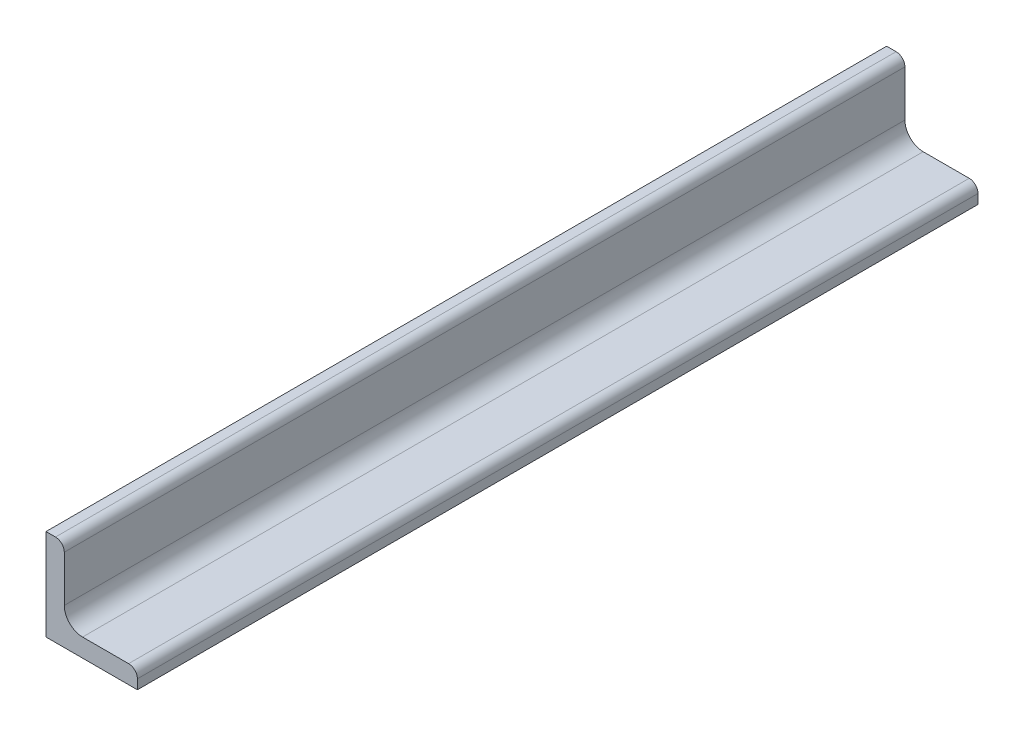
ISO-10303-21;
HEADER;
FILE_DESCRIPTION(('STEP AP214'),'2;1');
FILE_NAME('part.step','',(''),(''),'','','');
FILE_SCHEMA(('AUTOMOTIVE_DESIGN { 1 0 10303 214 1 1 1 1 }'));
ENDSEC;
DATA;
#1=APPLICATION_CONTEXT('core data for automotive mechanical design processes');
#2=APPLICATION_PROTOCOL_DEFINITION('international standard','automotive_design',2000,#1);
#3=PRODUCT_CONTEXT('',#1,'mechanical');
#4=PRODUCT('Part','Part','',(#3));
#5=PRODUCT_RELATED_PRODUCT_CATEGORY('part','',(#4));
#6=PRODUCT_DEFINITION_FORMATION('','',#4);
#7=PRODUCT_DEFINITION_CONTEXT('part definition',#1,'design');
#8=PRODUCT_DEFINITION('design','',#6,#7);
#9=PRODUCT_DEFINITION_SHAPE('','',#8);
#10=(LENGTH_UNIT() NAMED_UNIT(*) SI_UNIT(.MILLI.,.METRE.));
#11=(NAMED_UNIT(*) PLANE_ANGLE_UNIT() SI_UNIT($,.RADIAN.));
#12=(NAMED_UNIT(*) SI_UNIT($,.STERADIAN.) SOLID_ANGLE_UNIT());
#13=UNCERTAINTY_MEASURE_WITH_UNIT(LENGTH_MEASURE(1.E-05),#10,'distance_accuracy_value','');
#14=(GEOMETRIC_REPRESENTATION_CONTEXT(3) GLOBAL_UNCERTAINTY_ASSIGNED_CONTEXT((#13)) GLOBAL_UNIT_ASSIGNED_CONTEXT((#10,
#11,#12)) REPRESENTATION_CONTEXT('',''));
#15=CARTESIAN_POINT('',(0.,0.,0.));
#16=DIRECTION('',(0.,0.,1.));
#17=DIRECTION('',(1.,0.,0.));
#18=AXIS2_PLACEMENT_3D('',#15,#16,#17);
#19=CARTESIAN_POINT('',(25.,0.,115.));
#20=DIRECTION('',(0.,1.,0.));
#21=DIRECTION('',(-1.,0.,0.));
#22=AXIS2_PLACEMENT_3D('',#19,#20,#21);
#23=PLANE('',#22);
#24=DIRECTION('',(1.,0.,0.));
#25=VECTOR('',#24,1.);
#26=CARTESIAN_POINT('',(25.,0.,-115.));
#27=LINE('',#26,#25);
#28=CARTESIAN_POINT('',(0.,0.,-115.));
#29=VERTEX_POINT('',#28);
#30=CARTESIAN_POINT('',(25.,0.,-115.));
#31=VERTEX_POINT('',#30);
#32=EDGE_CURVE('E107',#29,#31,#27,.T.);
#33=ORIENTED_EDGE('',*,*,#32,.T.);
#34=DIRECTION('',(0.,0.,-1.));
#35=VECTOR('',#34,1.);
#36=CARTESIAN_POINT('',(25.,0.,115.));
#37=LINE('',#36,#35);
#38=CARTESIAN_POINT('',(25.,0.,115.));
#39=VERTEX_POINT('',#38);
#40=EDGE_CURVE('E113',#39,#31,#37,.T.);
#41=ORIENTED_EDGE('',*,*,#40,.F.);
#42=DIRECTION('',(1.,0.,0.));
#43=VECTOR('',#42,1.);
#44=CARTESIAN_POINT('',(25.,0.,115.));
#45=LINE('',#44,#43);
#46=CARTESIAN_POINT('',(0.,0.,115.));
#47=VERTEX_POINT('',#46);
#48=EDGE_CURVE('E138',#47,#39,#45,.T.);
#49=ORIENTED_EDGE('',*,*,#48,.F.);
#50=DIRECTION('',(0.,0.,-1.));
#51=VECTOR('',#50,1.);
#52=CARTESIAN_POINT('',(0.,0.,115.));
#53=LINE('',#52,#51);
#54=EDGE_CURVE('E125',#47,#29,#53,.T.);
#55=ORIENTED_EDGE('',*,*,#54,.T.);
#56=EDGE_LOOP('',(#33,#41,#49,#55));
#57=FACE_BOUND('',#56,.T.);
#58=ADVANCED_FACE('F33',(#57),#23,.F.);
#59=CARTESIAN_POINT('',(25.,5.,115.));
#60=DIRECTION('',(-1.,0.,0.));
#61=DIRECTION('',(0.,-1.,0.));
#62=AXIS2_PLACEMENT_3D('',#59,#60,#61);
#63=PLANE('',#62);
#64=DIRECTION('',(0.,1.,0.));
#65=VECTOR('',#64,1.);
#66=CARTESIAN_POINT('',(25.,5.,-115.));
#67=LINE('',#66,#65);
#68=CARTESIAN_POINT('',(25.,2.59999999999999,-115.));
#69=VERTEX_POINT('',#68);
#70=EDGE_CURVE('E101',#31,#69,#67,.T.);
#71=ORIENTED_EDGE('',*,*,#70,.T.);
#72=DIRECTION('',(0.,0.,-1.));
#73=VECTOR('',#72,1.);
#74=CARTESIAN_POINT('',(25.,2.59999999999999,115.));
#75=LINE('',#74,#73);
#76=CARTESIAN_POINT('',(25.,2.59999999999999,115.));
#77=VERTEX_POINT('',#76);
#78=EDGE_CURVE('E11',#69,#77,#75,.F.);
#79=ORIENTED_EDGE('',*,*,#78,.T.);
#80=DIRECTION('',(0.,1.,0.));
#81=VECTOR('',#80,1.);
#82=CARTESIAN_POINT('',(25.,5.,115.));
#83=LINE('',#82,#81);
#84=EDGE_CURVE('E115',#39,#77,#83,.T.);
#85=ORIENTED_EDGE('',*,*,#84,.F.);
#86=ORIENTED_EDGE('',*,*,#40,.T.);
#87=EDGE_LOOP('',(#71,#79,#85,#86));
#88=FACE_BOUND('',#87,.T.);
#89=ADVANCED_FACE('F114',(#88),#63,.F.);
#90=CARTESIAN_POINT('',(10.,5.,115.));
#91=DIRECTION('',(0.,-1.,0.));
#92=DIRECTION('',(1.,0.,0.));
#93=AXIS2_PLACEMENT_3D('',#90,#91,#92);
#94=PLANE('',#93);
#95=DIRECTION('',(-1.,0.,0.));
#96=VECTOR('',#95,1.);
#97=CARTESIAN_POINT('',(10.,5.,115.));
#98=LINE('',#97,#96);
#99=CARTESIAN_POINT('',(22.6,5.,115.));
#100=VERTEX_POINT('',#99);
#101=CARTESIAN_POINT('',(10.,5.,115.));
#102=VERTEX_POINT('',#101);
#103=EDGE_CURVE('E141',#100,#102,#98,.T.);
#104=ORIENTED_EDGE('',*,*,#103,.F.);
#105=DIRECTION('',(0.,0.,-1.));
#106=VECTOR('',#105,1.);
#107=CARTESIAN_POINT('',(22.6,5.,115.));
#108=LINE('',#107,#106);
#109=CARTESIAN_POINT('',(22.6,5.,-115.));
#110=VERTEX_POINT('',#109);
#111=EDGE_CURVE('E40',#100,#110,#108,.T.);
#112=ORIENTED_EDGE('',*,*,#111,.T.);
#113=DIRECTION('',(-1.,0.,0.));
#114=VECTOR('',#113,1.);
#115=CARTESIAN_POINT('',(10.,5.,-115.));
#116=LINE('',#115,#114);
#117=CARTESIAN_POINT('',(10.,5.,-115.));
#118=VERTEX_POINT('',#117);
#119=EDGE_CURVE('E110',#110,#118,#116,.T.);
#120=ORIENTED_EDGE('',*,*,#119,.T.);
#121=DIRECTION('',(0.,0.,-1.));
#122=VECTOR('',#121,1.);
#123=CARTESIAN_POINT('',(10.,5.,115.));
#124=LINE('',#123,#122);
#125=EDGE_CURVE('E121',#102,#118,#124,.T.);
#126=ORIENTED_EDGE('',*,*,#125,.F.);
#127=EDGE_LOOP('',(#104,#112,#120,#126));
#128=FACE_BOUND('',#127,.T.);
#129=ADVANCED_FACE('F175',(#128),#94,.F.);
#130=CARTESIAN_POINT('',(10.,9.99999999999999,115.));
#131=DIRECTION('',(0.,0.,-1.));
#132=DIRECTION('',(-1.,0.,0.));
#133=AXIS2_PLACEMENT_3D('',#130,#131,#132);
#134=CYLINDRICAL_SURFACE('',#133,5.);
#135=CARTESIAN_POINT('',(10.,9.99999999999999,-115.));
#136=DIRECTION('',(0.,0.,-1.));
#137=DIRECTION('',(-1.,0.,0.));
#138=AXIS2_PLACEMENT_3D('',#135,#136,#137);
#139=CIRCLE('',#138,5.);
#140=CARTESIAN_POINT('',(5.00000000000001,9.99999999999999,-115.));
#141=VERTEX_POINT('',#140);
#142=EDGE_CURVE('E129',#118,#141,#139,.T.);
#143=ORIENTED_EDGE('',*,*,#142,.T.);
#144=DIRECTION('',(0.,0.,-1.));
#145=VECTOR('',#144,1.);
#146=CARTESIAN_POINT('',(5.00000000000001,9.99999999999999,115.));
#147=LINE('',#146,#145);
#148=CARTESIAN_POINT('',(5.00000000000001,9.99999999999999,115.));
#149=VERTEX_POINT('',#148);
#150=EDGE_CURVE('E156',#149,#141,#147,.T.);
#151=ORIENTED_EDGE('',*,*,#150,.F.);
#152=CARTESIAN_POINT('',(10.,9.99999999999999,115.));
#153=DIRECTION('',(0.,0.,-1.));
#154=DIRECTION('',(-1.,0.,0.));
#155=AXIS2_PLACEMENT_3D('',#152,#153,#154);
#156=CIRCLE('',#155,5.);
#157=EDGE_CURVE('E143',#102,#149,#156,.T.);
#158=ORIENTED_EDGE('',*,*,#157,.F.);
#159=ORIENTED_EDGE('',*,*,#125,.T.);
#160=EDGE_LOOP('',(#143,#151,#158,#159));
#161=FACE_BOUND('',#160,.T.);
#162=ADVANCED_FACE('F182',(#161),#134,.F.);
#163=CARTESIAN_POINT('',(5.,25.,115.));
#164=DIRECTION('',(-1.,0.,0.));
#165=DIRECTION('',(0.,-1.,0.));
#166=AXIS2_PLACEMENT_3D('',#163,#164,#165);
#167=PLANE('',#166);
#168=DIRECTION('',(0.,1.,0.));
#169=VECTOR('',#168,1.);
#170=CARTESIAN_POINT('',(5.,25.,-115.));
#171=LINE('',#170,#169);
#172=CARTESIAN_POINT('',(5.,22.6,-115.));
#173=VERTEX_POINT('',#172);
#174=EDGE_CURVE('E131',#141,#173,#171,.T.);
#175=ORIENTED_EDGE('',*,*,#174,.T.);
#176=DIRECTION('',(0.,0.,-1.));
#177=VECTOR('',#176,1.);
#178=CARTESIAN_POINT('',(5.,22.6,115.));
#179=LINE('',#178,#177);
#180=CARTESIAN_POINT('',(5.,22.6,115.));
#181=VERTEX_POINT('',#180);
#182=EDGE_CURVE('E168',#173,#181,#179,.F.);
#183=ORIENTED_EDGE('',*,*,#182,.T.);
#184=DIRECTION('',(0.,1.,0.));
#185=VECTOR('',#184,1.);
#186=CARTESIAN_POINT('',(5.,25.,115.));
#187=LINE('',#186,#185);
#188=EDGE_CURVE('E145',#149,#181,#187,.T.);
#189=ORIENTED_EDGE('',*,*,#188,.F.);
#190=ORIENTED_EDGE('',*,*,#150,.T.);
#191=EDGE_LOOP('',(#175,#183,#189,#190));
#192=FACE_BOUND('',#191,.T.);
#193=ADVANCED_FACE('F186',(#192),#167,.F.);
#194=CARTESIAN_POINT('',(0.,25.,115.));
#195=DIRECTION('',(0.,-1.,0.));
#196=DIRECTION('',(0.,0.,-1.));
#197=AXIS2_PLACEMENT_3D('',#194,#195,#196);
#198=PLANE('',#197);
#199=DIRECTION('',(-1.,0.,0.));
#200=VECTOR('',#199,1.);
#201=CARTESIAN_POINT('',(0.,25.,115.));
#202=LINE('',#201,#200);
#203=CARTESIAN_POINT('',(2.6,25.,115.));
#204=VERTEX_POINT('',#203);
#205=CARTESIAN_POINT('',(0.,25.,115.));
#206=VERTEX_POINT('',#205);
#207=EDGE_CURVE('E148',#204,#206,#202,.T.);
#208=ORIENTED_EDGE('',*,*,#207,.F.);
#209=DIRECTION('',(0.,0.,-1.));
#210=VECTOR('',#209,1.);
#211=CARTESIAN_POINT('',(2.6,25.,115.));
#212=LINE('',#211,#210);
#213=CARTESIAN_POINT('',(2.6,25.,-115.));
#214=VERTEX_POINT('',#213);
#215=EDGE_CURVE('E120',#204,#214,#212,.T.);
#216=ORIENTED_EDGE('',*,*,#215,.T.);
#217=DIRECTION('',(-1.,0.,0.));
#218=VECTOR('',#217,1.);
#219=CARTESIAN_POINT('',(0.,25.,-115.));
#220=LINE('',#219,#218);
#221=CARTESIAN_POINT('',(0.,25.,-115.));
#222=VERTEX_POINT('',#221);
#223=EDGE_CURVE('E134',#214,#222,#220,.T.);
#224=ORIENTED_EDGE('',*,*,#223,.T.);
#225=DIRECTION('',(0.,0.,-1.));
#226=VECTOR('',#225,1.);
#227=CARTESIAN_POINT('',(0.,25.,115.));
#228=LINE('',#227,#226);
#229=EDGE_CURVE('E153',#206,#222,#228,.T.);
#230=ORIENTED_EDGE('',*,*,#229,.F.);
#231=EDGE_LOOP('',(#208,#216,#224,#230));
#232=FACE_BOUND('',#231,.T.);
#233=ADVANCED_FACE('F195',(#232),#198,.F.);
#234=CARTESIAN_POINT('',(0.,25.,115.));
#235=DIRECTION('',(1.,0.,0.));
#236=DIRECTION('',(0.,1.,0.));
#237=AXIS2_PLACEMENT_3D('',#234,#235,#236);
#238=PLANE('',#237);
#239=DIRECTION('',(0.,-1.,0.));
#240=VECTOR('',#239,1.);
#241=CARTESIAN_POINT('',(0.,25.,-115.));
#242=LINE('',#241,#240);
#243=EDGE_CURVE('E136',#222,#29,#242,.T.);
#244=ORIENTED_EDGE('',*,*,#243,.T.);
#245=ORIENTED_EDGE('',*,*,#54,.F.);
#246=DIRECTION('',(0.,-1.,0.));
#247=VECTOR('',#246,1.);
#248=CARTESIAN_POINT('',(0.,25.,115.));
#249=LINE('',#248,#247);
#250=EDGE_CURVE('E150',#206,#47,#249,.T.);
#251=ORIENTED_EDGE('',*,*,#250,.F.);
#252=ORIENTED_EDGE('',*,*,#229,.T.);
#253=EDGE_LOOP('',(#244,#245,#251,#252));
#254=FACE_BOUND('',#253,.T.);
#255=ADVANCED_FACE('F198',(#254),#238,.F.);
#256=CARTESIAN_POINT('',(10.,9.99999999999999,115.));
#257=DIRECTION('',(0.,0.,-1.));
#258=DIRECTION('',(-1.,0.,0.));
#259=AXIS2_PLACEMENT_3D('',#256,#257,#258);
#260=PLANE('',#259);
#261=ORIENTED_EDGE('',*,*,#188,.T.);
#262=CARTESIAN_POINT('',(2.6,22.6,115.));
#263=DIRECTION('',(0.,0.,-1.));
#264=DIRECTION('',(-1.,0.,0.));
#265=AXIS2_PLACEMENT_3D('',#262,#263,#264);
#266=CIRCLE('',#265,2.4);
#267=EDGE_CURVE('E171',#181,#204,#266,.F.);
#268=ORIENTED_EDGE('',*,*,#267,.T.);
#269=ORIENTED_EDGE('',*,*,#207,.T.);
#270=ORIENTED_EDGE('',*,*,#250,.T.);
#271=ORIENTED_EDGE('',*,*,#48,.T.);
#272=ORIENTED_EDGE('',*,*,#84,.T.);
#273=CARTESIAN_POINT('',(22.6,2.6,115.));
#274=DIRECTION('',(0.,0.,-1.));
#275=DIRECTION('',(-1.,0.,0.));
#276=AXIS2_PLACEMENT_3D('',#273,#274,#275);
#277=CIRCLE('',#276,2.4);
#278=EDGE_CURVE('E47',#77,#100,#277,.F.);
#279=ORIENTED_EDGE('',*,*,#278,.T.);
#280=ORIENTED_EDGE('',*,*,#103,.T.);
#281=ORIENTED_EDGE('',*,*,#157,.T.);
#282=EDGE_LOOP('',(#261,#268,#269,#270,#271,#272,#279,#280,#281));
#283=FACE_BOUND('',#282,.T.);
#284=ADVANCED_FACE('F189',(#283),#260,.F.);
#285=CARTESIAN_POINT('',(10.,9.99999999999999,-115.));
#286=DIRECTION('',(0.,0.,-1.));
#287=DIRECTION('',(-1.,0.,0.));
#288=AXIS2_PLACEMENT_3D('',#285,#286,#287);
#289=PLANE('',#288);
#290=ORIENTED_EDGE('',*,*,#223,.F.);
#291=CARTESIAN_POINT('',(2.6,22.6,-115.));
#292=DIRECTION('',(0.,0.,-1.));
#293=DIRECTION('',(-1.,0.,0.));
#294=AXIS2_PLACEMENT_3D('',#291,#292,#293);
#295=CIRCLE('',#294,2.4);
#296=EDGE_CURVE('E166',#214,#173,#295,.T.);
#297=ORIENTED_EDGE('',*,*,#296,.T.);
#298=ORIENTED_EDGE('',*,*,#174,.F.);
#299=ORIENTED_EDGE('',*,*,#142,.F.);
#300=ORIENTED_EDGE('',*,*,#119,.F.);
#301=CARTESIAN_POINT('',(22.6,2.6,-115.));
#302=DIRECTION('',(0.,0.,-1.));
#303=DIRECTION('',(-1.,0.,0.));
#304=AXIS2_PLACEMENT_3D('',#301,#302,#303);
#305=CIRCLE('',#304,2.4);
#306=EDGE_CURVE('E109',#110,#69,#305,.T.);
#307=ORIENTED_EDGE('',*,*,#306,.T.);
#308=ORIENTED_EDGE('',*,*,#70,.F.);
#309=ORIENTED_EDGE('',*,*,#32,.F.);
#310=ORIENTED_EDGE('',*,*,#243,.F.);
#311=EDGE_LOOP('',(#290,#297,#298,#299,#300,#307,#308,#309,#310));
#312=FACE_BOUND('',#311,.T.);
#313=ADVANCED_FACE('F104',(#312),#289,.T.);
#314=CARTESIAN_POINT('',(2.6,22.6,115.));
#315=DIRECTION('',(0.,0.,-1.));
#316=DIRECTION('',(-1.,0.,0.));
#317=AXIS2_PLACEMENT_3D('',#314,#315,#316);
#318=CYLINDRICAL_SURFACE('',#317,2.4);
#319=ORIENTED_EDGE('',*,*,#267,.F.);
#320=ORIENTED_EDGE('',*,*,#182,.F.);
#321=ORIENTED_EDGE('',*,*,#296,.F.);
#322=ORIENTED_EDGE('',*,*,#215,.F.);
#323=EDGE_LOOP('',(#319,#320,#321,#322));
#324=FACE_BOUND('',#323,.T.);
#325=ADVANCED_FACE('F193',(#324),#318,.T.);
#326=CARTESIAN_POINT('',(22.6,2.6,115.));
#327=DIRECTION('',(0.,0.,-1.));
#328=DIRECTION('',(-1.,0.,0.));
#329=AXIS2_PLACEMENT_3D('',#326,#327,#328);
#330=CYLINDRICAL_SURFACE('',#329,2.4);
#331=ORIENTED_EDGE('',*,*,#278,.F.);
#332=ORIENTED_EDGE('',*,*,#78,.F.);
#333=ORIENTED_EDGE('',*,*,#306,.F.);
#334=ORIENTED_EDGE('',*,*,#111,.F.);
#335=EDGE_LOOP('',(#331,#332,#333,#334));
#336=FACE_BOUND('',#335,.T.);
#337=ADVANCED_FACE('F200',(#336),#330,.T.);
#338=CLOSED_SHELL('',(#58,#89,#129,#162,#193,#233,#255,#284,#313,#325,#337));
#339=MANIFOLD_SOLID_BREP('B2',#338);
#340=ADVANCED_BREP_SHAPE_REPRESENTATION('',(#18,#339),#14);
#341=SHAPE_DEFINITION_REPRESENTATION(#9,#340);
ENDSEC;
END-ISO-10303-21;
